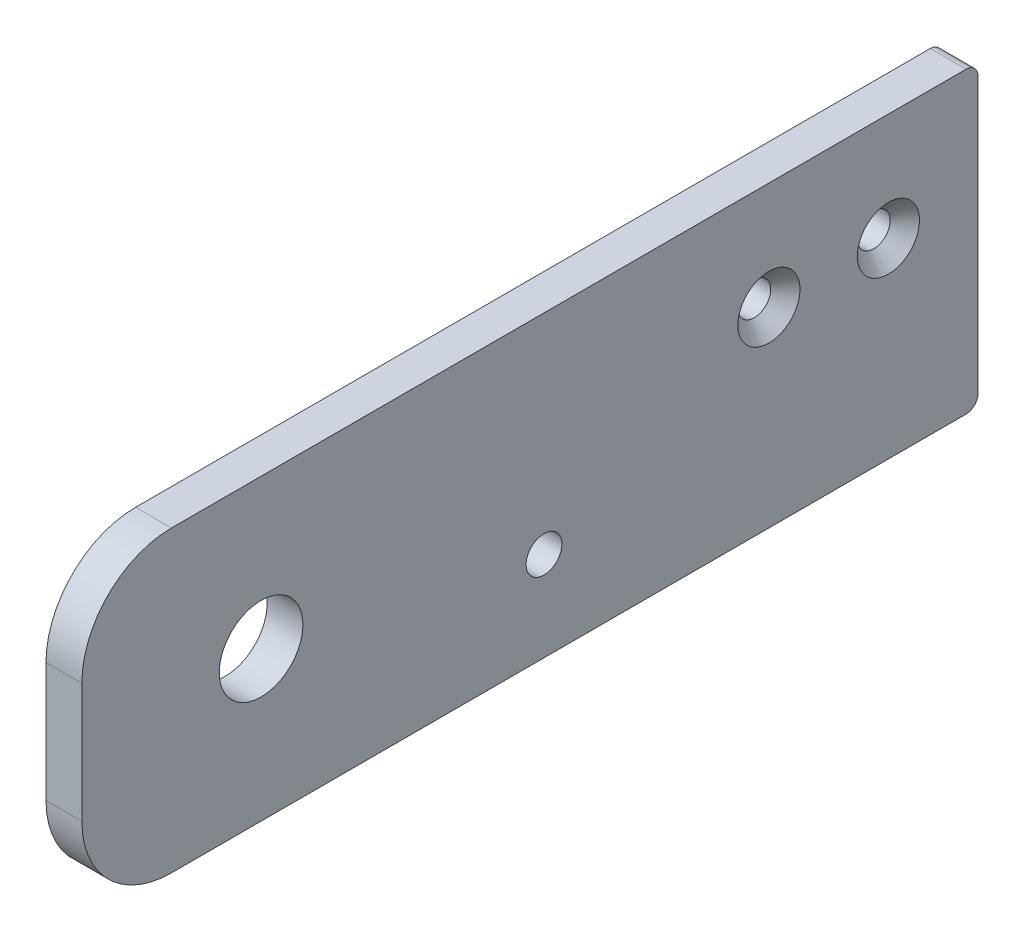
ISO-10303-21;
HEADER;
FILE_DESCRIPTION(('STEP AP214'),'2;1');
FILE_NAME('part.step','',(''),(''),'','','');
FILE_SCHEMA(('AUTOMOTIVE_DESIGN { 1 0 10303 214 1 1 1 1 }'));
ENDSEC;
DATA;
#1=APPLICATION_CONTEXT('core data for automotive mechanical design processes');
#2=APPLICATION_PROTOCOL_DEFINITION('international standard','automotive_design',2000,#1);
#3=PRODUCT_CONTEXT('',#1,'mechanical');
#4=PRODUCT('Part','Part','',(#3));
#5=PRODUCT_RELATED_PRODUCT_CATEGORY('part','',(#4));
#6=PRODUCT_DEFINITION_FORMATION('','',#4);
#7=PRODUCT_DEFINITION_CONTEXT('part definition',#1,'design');
#8=PRODUCT_DEFINITION('design','',#6,#7);
#9=PRODUCT_DEFINITION_SHAPE('','',#8);
#10=(LENGTH_UNIT() NAMED_UNIT(*) SI_UNIT(.MILLI.,.METRE.));
#11=(NAMED_UNIT(*) PLANE_ANGLE_UNIT() SI_UNIT($,.RADIAN.));
#12=(NAMED_UNIT(*) SI_UNIT($,.STERADIAN.) SOLID_ANGLE_UNIT());
#13=UNCERTAINTY_MEASURE_WITH_UNIT(LENGTH_MEASURE(1.E-05),#10,'distance_accuracy_value','');
#14=(GEOMETRIC_REPRESENTATION_CONTEXT(3) GLOBAL_UNCERTAINTY_ASSIGNED_CONTEXT((#13)) GLOBAL_UNIT_ASSIGNED_CONTEXT((#10,
#11,#12)) REPRESENTATION_CONTEXT('',''));
#15=CARTESIAN_POINT('',(0.,0.,0.));
#16=DIRECTION('',(0.,0.,1.));
#17=DIRECTION('',(1.,0.,0.));
#18=AXIS2_PLACEMENT_3D('',#15,#16,#17);
#19=CARTESIAN_POINT('',(0.,-50.,0.));
#20=DIRECTION('',(0.,0.,-1.));
#21=DIRECTION('',(0.,1.,0.));
#22=AXIS2_PLACEMENT_3D('',#19,#20,#21);
#23=PLANE('',#22);
#24=DIRECTION('',(0.,1.,0.));
#25=VECTOR('',#24,1.);
#26=CARTESIAN_POINT('',(0.,-50.,0.));
#27=LINE('',#26,#25);
#28=CARTESIAN_POINT('',(0.,-48.,0.));
#29=VERTEX_POINT('',#28);
#30=CARTESIAN_POINT('',(0.,-2.00000000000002,0.));
#31=VERTEX_POINT('',#30);
#32=EDGE_CURVE('E105',#29,#31,#27,.T.);
#33=ORIENTED_EDGE('',*,*,#32,.T.);
#34=DIRECTION('',(1.,0.,0.));
#35=VECTOR('',#34,1.);
#36=CARTESIAN_POINT('',(0.,-2.00000000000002,0.));
#37=LINE('',#36,#35);
#38=CARTESIAN_POINT('',(6.00000000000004,-2.00000000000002,0.));
#39=VERTEX_POINT('',#38);
#40=EDGE_CURVE('E147',#31,#39,#37,.T.);
#41=ORIENTED_EDGE('',*,*,#40,.T.);
#42=DIRECTION('',(0.,1.,0.));
#43=VECTOR('',#42,1.);
#44=CARTESIAN_POINT('',(6.00000000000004,-50.,0.));
#45=LINE('',#44,#43);
#46=CARTESIAN_POINT('',(6.00000000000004,-48.,0.));
#47=VERTEX_POINT('',#46);
#48=EDGE_CURVE('E153',#47,#39,#45,.T.);
#49=ORIENTED_EDGE('',*,*,#48,.F.);
#50=DIRECTION('',(1.,0.,0.));
#51=VECTOR('',#50,1.);
#52=CARTESIAN_POINT('',(0.,-48.,0.));
#53=LINE('',#52,#51);
#54=EDGE_CURVE('E114',#47,#29,#53,.F.);
#55=ORIENTED_EDGE('',*,*,#54,.T.);
#56=EDGE_LOOP('',(#33,#41,#49,#55));
#57=FACE_BOUND('',#56,.T.);
#58=ADVANCED_FACE('F34',(#57),#23,.T.);
#59=CARTESIAN_POINT('',(0.,-50.,150.));
#60=DIRECTION('',(0.,-1.,0.));
#61=DIRECTION('',(0.,0.,-1.));
#62=AXIS2_PLACEMENT_3D('',#59,#60,#61);
#63=PLANE('',#62);
#64=DIRECTION('',(0.,0.,-1.));
#65=VECTOR('',#64,1.);
#66=CARTESIAN_POINT('',(6.00000000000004,-50.,150.));
#67=LINE('',#66,#65);
#68=CARTESIAN_POINT('',(6.00000000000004,-50.,135.));
#69=VERTEX_POINT('',#68);
#70=CARTESIAN_POINT('',(6.00000000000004,-50.,2.));
#71=VERTEX_POINT('',#70);
#72=EDGE_CURVE('E95',#69,#71,#67,.T.);
#73=ORIENTED_EDGE('',*,*,#72,.F.);
#74=DIRECTION('',(1.,0.,0.));
#75=VECTOR('',#74,1.);
#76=CARTESIAN_POINT('',(0.,-50.,135.));
#77=LINE('',#76,#75);
#78=CARTESIAN_POINT('',(0.,-50.,135.));
#79=VERTEX_POINT('',#78);
#80=EDGE_CURVE('E132',#69,#79,#77,.F.);
#81=ORIENTED_EDGE('',*,*,#80,.T.);
#82=DIRECTION('',(0.,0.,-1.));
#83=VECTOR('',#82,1.);
#84=CARTESIAN_POINT('',(0.,-50.,150.));
#85=LINE('',#84,#83);
#86=CARTESIAN_POINT('',(0.,-50.,2.));
#87=VERTEX_POINT('',#86);
#88=EDGE_CURVE('E118',#79,#87,#85,.T.);
#89=ORIENTED_EDGE('',*,*,#88,.T.);
#90=DIRECTION('',(1.,0.,0.));
#91=VECTOR('',#90,1.);
#92=CARTESIAN_POINT('',(0.,-50.,2.));
#93=LINE('',#92,#91);
#94=EDGE_CURVE('E113',#87,#71,#93,.T.);
#95=ORIENTED_EDGE('',*,*,#94,.T.);
#96=EDGE_LOOP('',(#73,#81,#89,#95));
#97=FACE_BOUND('',#96,.T.);
#98=ADVANCED_FACE('F116',(#97),#63,.T.);
#99=CARTESIAN_POINT('',(0.,0.,150.));
#100=DIRECTION('',(0.,0.,1.));
#101=DIRECTION('',(1.,0.,0.));
#102=AXIS2_PLACEMENT_3D('',#99,#100,#101);
#103=PLANE('',#102);
#104=DIRECTION('',(0.,-1.,0.));
#105=VECTOR('',#104,1.);
#106=CARTESIAN_POINT('',(6.00000000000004,0.,150.));
#107=LINE('',#106,#105);
#108=CARTESIAN_POINT('',(6.00000000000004,-15.,150.));
#109=VERTEX_POINT('',#108);
#110=CARTESIAN_POINT('',(6.00000000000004,-35.,150.));
#111=VERTEX_POINT('',#110);
#112=EDGE_CURVE('E106',#109,#111,#107,.T.);
#113=ORIENTED_EDGE('',*,*,#112,.F.);
#114=DIRECTION('',(1.,0.,0.));
#115=VECTOR('',#114,1.);
#116=CARTESIAN_POINT('',(0.,-15.,150.));
#117=LINE('',#116,#115);
#118=CARTESIAN_POINT('',(0.,-15.,150.));
#119=VERTEX_POINT('',#118);
#120=EDGE_CURVE('E142',#109,#119,#117,.F.);
#121=ORIENTED_EDGE('',*,*,#120,.T.);
#122=DIRECTION('',(0.,-1.,0.));
#123=VECTOR('',#122,1.);
#124=CARTESIAN_POINT('',(0.,0.,150.));
#125=LINE('',#124,#123);
#126=CARTESIAN_POINT('',(0.,-35.,150.));
#127=VERTEX_POINT('',#126);
#128=EDGE_CURVE('E121',#119,#127,#125,.T.);
#129=ORIENTED_EDGE('',*,*,#128,.T.);
#130=DIRECTION('',(1.,0.,0.));
#131=VECTOR('',#130,1.);
#132=CARTESIAN_POINT('',(0.,-35.,150.));
#133=LINE('',#132,#131);
#134=EDGE_CURVE('E128',#127,#111,#133,.T.);
#135=ORIENTED_EDGE('',*,*,#134,.T.);
#136=EDGE_LOOP('',(#113,#121,#129,#135));
#137=FACE_BOUND('',#136,.T.);
#138=ADVANCED_FACE('F173',(#137),#103,.T.);
#139=CARTESIAN_POINT('',(0.,0.,0.));
#140=DIRECTION('',(0.,1.,0.));
#141=DIRECTION('',(0.,0.,1.));
#142=AXIS2_PLACEMENT_3D('',#139,#140,#141);
#143=PLANE('',#142);
#144=DIRECTION('',(0.,0.,1.));
#145=VECTOR('',#144,1.);
#146=CARTESIAN_POINT('',(6.00000000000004,0.,0.));
#147=LINE('',#146,#145);
#148=CARTESIAN_POINT('',(6.00000000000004,0.,1.99999999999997));
#149=VERTEX_POINT('',#148);
#150=CARTESIAN_POINT('',(6.00000000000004,0.,135.));
#151=VERTEX_POINT('',#150);
#152=EDGE_CURVE('E157',#149,#151,#147,.T.);
#153=ORIENTED_EDGE('',*,*,#152,.F.);
#154=DIRECTION('',(1.,0.,0.));
#155=VECTOR('',#154,1.);
#156=CARTESIAN_POINT('',(0.,0.,1.99999999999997));
#157=LINE('',#156,#155);
#158=CARTESIAN_POINT('',(0.,0.,1.99999999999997));
#159=VERTEX_POINT('',#158);
#160=EDGE_CURVE('E42',#149,#159,#157,.F.);
#161=ORIENTED_EDGE('',*,*,#160,.T.);
#162=DIRECTION('',(0.,0.,1.));
#163=VECTOR('',#162,1.);
#164=CARTESIAN_POINT('',(0.,0.,0.));
#165=LINE('',#164,#163);
#166=CARTESIAN_POINT('',(0.,0.,135.));
#167=VERTEX_POINT('',#166);
#168=EDGE_CURVE('E177',#159,#167,#165,.T.);
#169=ORIENTED_EDGE('',*,*,#168,.T.);
#170=DIRECTION('',(1.,0.,0.));
#171=VECTOR('',#170,1.);
#172=CARTESIAN_POINT('',(0.,0.,135.));
#173=LINE('',#172,#171);
#174=EDGE_CURVE('E137',#167,#151,#173,.T.);
#175=ORIENTED_EDGE('',*,*,#174,.T.);
#176=EDGE_LOOP('',(#153,#161,#169,#175));
#177=FACE_BOUND('',#176,.T.);
#178=ADVANCED_FACE('F229',(#177),#143,.T.);
#179=CARTESIAN_POINT('',(0.,0.,0.));
#180=DIRECTION('',(1.,0.,0.));
#181=DIRECTION('',(0.,0.,-1.));
#182=AXIS2_PLACEMENT_3D('',#179,#180,#181);
#183=PLANE('',#182);
#184=CARTESIAN_POINT('',(0.,-25.,120.));
#185=DIRECTION('',(1.,0.,0.));
#186=DIRECTION('',(0.,0.,-1.));
#187=AXIS2_PLACEMENT_3D('',#184,#185,#186);
#188=CIRCLE('',#187,7.);
#189=CARTESIAN_POINT('',(0.,-25.,113.));
#190=VERTEX_POINT('',#189);
#191=EDGE_CURVE('E202',#190,#190,#188,.T.);
#192=ORIENTED_EDGE('',*,*,#191,.T.);
#193=EDGE_LOOP('',(#192));
#194=FACE_BOUND('',#193,.T.);
#195=CARTESIAN_POINT('',(0.,-18.,15.));
#196=DIRECTION('',(1.,0.,0.));
#197=DIRECTION('',(0.,0.,-1.));
#198=AXIS2_PLACEMENT_3D('',#195,#196,#197);
#199=CIRCLE('',#198,2.74999999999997);
#200=CARTESIAN_POINT('',(0.,-18.,12.25));
#201=VERTEX_POINT('',#200);
#202=EDGE_CURVE('E193',#201,#201,#199,.T.);
#203=ORIENTED_EDGE('',*,*,#202,.T.);
#204=EDGE_LOOP('',(#203));
#205=FACE_BOUND('',#204,.T.);
#206=CARTESIAN_POINT('',(0.,-18.,35.));
#207=DIRECTION('',(1.,0.,0.));
#208=DIRECTION('',(0.,0.,-1.));
#209=AXIS2_PLACEMENT_3D('',#206,#207,#208);
#210=CIRCLE('',#209,2.74999999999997);
#211=CARTESIAN_POINT('',(0.,-18.,32.25));
#212=VERTEX_POINT('',#211);
#213=EDGE_CURVE('E183',#212,#212,#210,.T.);
#214=ORIENTED_EDGE('',*,*,#213,.T.);
#215=EDGE_LOOP('',(#214));
#216=FACE_BOUND('',#215,.T.);
#217=CARTESIAN_POINT('',(0.,-35.,72.6436815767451));
#218=DIRECTION('',(-1.,0.,0.));
#219=DIRECTION('',(0.,-1.,0.));
#220=AXIS2_PLACEMENT_3D('',#217,#218,#219);
#221=CIRCLE('',#220,3.00000000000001);
#222=CARTESIAN_POINT('',(0.,-38.,72.6436815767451));
#223=VERTEX_POINT('',#222);
#224=EDGE_CURVE('E162',#223,#223,#221,.T.);
#225=ORIENTED_EDGE('',*,*,#224,.F.);
#226=EDGE_LOOP('',(#225));
#227=FACE_BOUND('',#226,.T.);
#228=ORIENTED_EDGE('',*,*,#168,.F.);
#229=CARTESIAN_POINT('',(0.,-2.00000000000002,1.99999999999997));
#230=DIRECTION('',(1.,0.,0.));
#231=DIRECTION('',(0.,0.,-1.));
#232=AXIS2_PLACEMENT_3D('',#229,#230,#231);
#233=CIRCLE('',#232,2.);
#234=EDGE_CURVE('E11',#159,#31,#233,.F.);
#235=ORIENTED_EDGE('',*,*,#234,.T.);
#236=ORIENTED_EDGE('',*,*,#32,.F.);
#237=CARTESIAN_POINT('',(0.,-48.,2.));
#238=DIRECTION('',(1.,0.,0.));
#239=DIRECTION('',(0.,0.,-1.));
#240=AXIS2_PLACEMENT_3D('',#237,#238,#239);
#241=CIRCLE('',#240,2.);
#242=EDGE_CURVE('E126',#29,#87,#241,.F.);
#243=ORIENTED_EDGE('',*,*,#242,.T.);
#244=ORIENTED_EDGE('',*,*,#88,.F.);
#245=CARTESIAN_POINT('',(0.,-35.,135.));
#246=DIRECTION('',(1.,0.,0.));
#247=DIRECTION('',(0.,0.,-1.));
#248=AXIS2_PLACEMENT_3D('',#245,#246,#247);
#249=CIRCLE('',#248,15.);
#250=EDGE_CURVE('E134',#79,#127,#249,.F.);
#251=ORIENTED_EDGE('',*,*,#250,.T.);
#252=ORIENTED_EDGE('',*,*,#128,.F.);
#253=CARTESIAN_POINT('',(0.,-15.,135.));
#254=DIRECTION('',(1.,0.,0.));
#255=DIRECTION('',(0.,0.,-1.));
#256=AXIS2_PLACEMENT_3D('',#253,#254,#255);
#257=CIRCLE('',#256,15.);
#258=EDGE_CURVE('E144',#119,#167,#257,.F.);
#259=ORIENTED_EDGE('',*,*,#258,.T.);
#260=EDGE_LOOP('',(#228,#235,#236,#243,#244,#251,#252,#259));
#261=FACE_BOUND('',#260,.T.);
#262=ADVANCED_FACE('F178',(#194,#205,#216,#227,#261),#183,.F.);
#263=CARTESIAN_POINT('',(6.00000000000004,0.,0.));
#264=DIRECTION('',(1.,0.,0.));
#265=DIRECTION('',(0.,0.,-1.));
#266=AXIS2_PLACEMENT_3D('',#263,#264,#265);
#267=PLANE('',#266);
#268=CARTESIAN_POINT('',(6.00000000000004,-25.,120.));
#269=DIRECTION('',(1.,0.,0.));
#270=DIRECTION('',(0.,0.,-1.));
#271=AXIS2_PLACEMENT_3D('',#268,#269,#270);
#272=CIRCLE('',#271,7.);
#273=CARTESIAN_POINT('',(6.00000000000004,-25.,113.));
#274=VERTEX_POINT('',#273);
#275=EDGE_CURVE('E205',#274,#274,#272,.T.);
#276=ORIENTED_EDGE('',*,*,#275,.F.);
#277=EDGE_LOOP('',(#276));
#278=FACE_BOUND('',#277,.T.);
#279=CARTESIAN_POINT('',(6.00000000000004,-18.,15.));
#280=DIRECTION('',(1.,0.,0.));
#281=DIRECTION('',(0.,0.,-1.));
#282=AXIS2_PLACEMENT_3D('',#279,#280,#281);
#283=CIRCLE('',#282,5.20000000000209);
#284=CARTESIAN_POINT('',(6.00000000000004,-18.,9.79999999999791));
#285=VERTEX_POINT('',#284);
#286=EDGE_CURVE('E199',#285,#285,#283,.T.);
#287=ORIENTED_EDGE('',*,*,#286,.F.);
#288=EDGE_LOOP('',(#287));
#289=FACE_BOUND('',#288,.T.);
#290=CARTESIAN_POINT('',(6.00000000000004,-18.,35.));
#291=DIRECTION('',(1.,0.,0.));
#292=DIRECTION('',(0.,0.,-1.));
#293=AXIS2_PLACEMENT_3D('',#290,#291,#292);
#294=CIRCLE('',#293,5.20000000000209);
#295=CARTESIAN_POINT('',(6.00000000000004,-18.,29.7999999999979));
#296=VERTEX_POINT('',#295);
#297=EDGE_CURVE('E190',#296,#296,#294,.T.);
#298=ORIENTED_EDGE('',*,*,#297,.F.);
#299=EDGE_LOOP('',(#298));
#300=FACE_BOUND('',#299,.T.);
#301=CARTESIAN_POINT('',(6.00000000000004,-35.,72.6436815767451));
#302=DIRECTION('',(-1.,0.,0.));
#303=DIRECTION('',(0.,-1.,0.));
#304=AXIS2_PLACEMENT_3D('',#301,#302,#303);
#305=CIRCLE('',#304,3.00000000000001);
#306=CARTESIAN_POINT('',(6.00000000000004,-38.,72.6436815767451));
#307=VERTEX_POINT('',#306);
#308=EDGE_CURVE('E158',#307,#307,#305,.T.);
#309=ORIENTED_EDGE('',*,*,#308,.T.);
#310=EDGE_LOOP('',(#309));
#311=FACE_BOUND('',#310,.T.);
#312=ORIENTED_EDGE('',*,*,#48,.T.);
#313=CARTESIAN_POINT('',(6.00000000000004,-2.00000000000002,1.99999999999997));
#314=DIRECTION('',(1.,0.,0.));
#315=DIRECTION('',(0.,0.,-1.));
#316=AXIS2_PLACEMENT_3D('',#313,#314,#315);
#317=CIRCLE('',#316,2.);
#318=EDGE_CURVE('E56',#39,#149,#317,.T.);
#319=ORIENTED_EDGE('',*,*,#318,.T.);
#320=ORIENTED_EDGE('',*,*,#152,.T.);
#321=CARTESIAN_POINT('',(6.00000000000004,-15.,135.));
#322=DIRECTION('',(1.,0.,0.));
#323=DIRECTION('',(0.,0.,-1.));
#324=AXIS2_PLACEMENT_3D('',#321,#322,#323);
#325=CIRCLE('',#324,15.);
#326=EDGE_CURVE('E140',#151,#109,#325,.T.);
#327=ORIENTED_EDGE('',*,*,#326,.T.);
#328=ORIENTED_EDGE('',*,*,#112,.T.);
#329=CARTESIAN_POINT('',(6.00000000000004,-35.,135.));
#330=DIRECTION('',(1.,0.,0.));
#331=DIRECTION('',(0.,0.,-1.));
#332=AXIS2_PLACEMENT_3D('',#329,#330,#331);
#333=CIRCLE('',#332,15.);
#334=EDGE_CURVE('E101',#111,#69,#333,.T.);
#335=ORIENTED_EDGE('',*,*,#334,.T.);
#336=ORIENTED_EDGE('',*,*,#72,.T.);
#337=CARTESIAN_POINT('',(6.00000000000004,-48.,2.));
#338=DIRECTION('',(1.,0.,0.));
#339=DIRECTION('',(0.,0.,-1.));
#340=AXIS2_PLACEMENT_3D('',#337,#338,#339);
#341=CIRCLE('',#340,2.);
#342=EDGE_CURVE('E98',#71,#47,#341,.T.);
#343=ORIENTED_EDGE('',*,*,#342,.T.);
#344=EDGE_LOOP('',(#312,#319,#320,#327,#328,#335,#336,#343));
#345=FACE_BOUND('',#344,.T.);
#346=ADVANCED_FACE('F97',(#278,#289,#300,#311,#345),#267,.T.);
#347=CARTESIAN_POINT('',(6.00000000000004,-35.,72.6436815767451));
#348=DIRECTION('',(-1.,0.,0.));
#349=DIRECTION('',(0.,-1.,0.));
#350=AXIS2_PLACEMENT_3D('',#347,#348,#349);
#351=CYLINDRICAL_SURFACE('',#350,3.00000000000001);
#352=ORIENTED_EDGE('',*,*,#308,.F.);
#353=EDGE_LOOP('',(#352));
#354=FACE_BOUND('',#353,.T.);
#355=ORIENTED_EDGE('',*,*,#224,.T.);
#356=EDGE_LOOP('',(#355));
#357=FACE_BOUND('',#356,.T.);
#358=ADVANCED_FACE('F214',(#354,#357),#351,.F.);
#359=CARTESIAN_POINT('',(6.00000000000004,-18.,35.));
#360=DIRECTION('',(1.,0.,0.));
#361=DIRECTION('',(0.,0.,-1.));
#362=AXIS2_PLACEMENT_3D('',#359,#360,#361);
#363=CYLINDRICAL_SURFACE('',#362,2.74999999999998);
#364=ORIENTED_EDGE('',*,*,#213,.F.);
#365=EDGE_LOOP('',(#364));
#366=FACE_BOUND('',#365,.T.);
#367=CARTESIAN_POINT('',(3.54999999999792,-18.,35.));
#368=DIRECTION('',(1.,0.,0.));
#369=DIRECTION('',(0.,0.,-1.));
#370=AXIS2_PLACEMENT_3D('',#367,#368,#369);
#371=CIRCLE('',#370,2.74999999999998);
#372=CARTESIAN_POINT('',(3.54999999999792,-18.,32.25));
#373=VERTEX_POINT('',#372);
#374=EDGE_CURVE('E187',#373,#373,#371,.T.);
#375=ORIENTED_EDGE('',*,*,#374,.T.);
#376=EDGE_LOOP('',(#375));
#377=FACE_BOUND('',#376,.T.);
#378=ADVANCED_FACE('F224',(#366,#377),#363,.F.);
#379=CARTESIAN_POINT('',(6.00000000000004,-18.,35.));
#380=DIRECTION('',(1.,0.,0.));
#381=DIRECTION('',(0.,0.,-1.));
#382=AXIS2_PLACEMENT_3D('',#379,#380,#381);
#383=CONICAL_SURFACE('',#382,5.20000000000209,0.785398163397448);
#384=ORIENTED_EDGE('',*,*,#374,.F.);
#385=EDGE_LOOP('',(#384));
#386=FACE_BOUND('',#385,.T.);
#387=ORIENTED_EDGE('',*,*,#297,.T.);
#388=EDGE_LOOP('',(#387));
#389=FACE_BOUND('',#388,.T.);
#390=ADVANCED_FACE('F269',(#386,#389),#383,.F.);
#391=CARTESIAN_POINT('',(6.00000000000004,-18.,15.));
#392=DIRECTION('',(1.,0.,0.));
#393=DIRECTION('',(0.,0.,-1.));
#394=AXIS2_PLACEMENT_3D('',#391,#392,#393);
#395=CYLINDRICAL_SURFACE('',#394,2.74999999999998);
#396=ORIENTED_EDGE('',*,*,#202,.F.);
#397=EDGE_LOOP('',(#396));
#398=FACE_BOUND('',#397,.T.);
#399=CARTESIAN_POINT('',(3.54999999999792,-18.,15.));
#400=DIRECTION('',(1.,0.,0.));
#401=DIRECTION('',(0.,0.,-1.));
#402=AXIS2_PLACEMENT_3D('',#399,#400,#401);
#403=CIRCLE('',#402,2.74999999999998);
#404=CARTESIAN_POINT('',(3.54999999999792,-18.,12.25));
#405=VERTEX_POINT('',#404);
#406=EDGE_CURVE('E196',#405,#405,#403,.T.);
#407=ORIENTED_EDGE('',*,*,#406,.T.);
#408=EDGE_LOOP('',(#407));
#409=FACE_BOUND('',#408,.T.);
#410=ADVANCED_FACE('F265',(#398,#409),#395,.F.);
#411=CARTESIAN_POINT('',(6.00000000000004,-18.,15.));
#412=DIRECTION('',(1.,0.,0.));
#413=DIRECTION('',(0.,0.,-1.));
#414=AXIS2_PLACEMENT_3D('',#411,#412,#413);
#415=CONICAL_SURFACE('',#414,5.20000000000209,0.785398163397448);
#416=ORIENTED_EDGE('',*,*,#406,.F.);
#417=EDGE_LOOP('',(#416));
#418=FACE_BOUND('',#417,.T.);
#419=ORIENTED_EDGE('',*,*,#286,.T.);
#420=EDGE_LOOP('',(#419));
#421=FACE_BOUND('',#420,.T.);
#422=ADVANCED_FACE('F247',(#418,#421),#415,.F.);
#423=CARTESIAN_POINT('',(0.,-48.,2.));
#424=DIRECTION('',(1.,0.,0.));
#425=DIRECTION('',(0.,0.,-1.));
#426=AXIS2_PLACEMENT_3D('',#423,#424,#425);
#427=CYLINDRICAL_SURFACE('',#426,2.);
#428=ORIENTED_EDGE('',*,*,#242,.F.);
#429=ORIENTED_EDGE('',*,*,#54,.F.);
#430=ORIENTED_EDGE('',*,*,#342,.F.);
#431=ORIENTED_EDGE('',*,*,#94,.F.);
#432=EDGE_LOOP('',(#428,#429,#430,#431));
#433=FACE_BOUND('',#432,.T.);
#434=ADVANCED_FACE('F112',(#433),#427,.T.);
#435=CARTESIAN_POINT('',(0.,-35.,135.));
#436=DIRECTION('',(1.,0.,0.));
#437=DIRECTION('',(0.,0.,-1.));
#438=AXIS2_PLACEMENT_3D('',#435,#436,#437);
#439=CYLINDRICAL_SURFACE('',#438,15.);
#440=ORIENTED_EDGE('',*,*,#250,.F.);
#441=ORIENTED_EDGE('',*,*,#80,.F.);
#442=ORIENTED_EDGE('',*,*,#334,.F.);
#443=ORIENTED_EDGE('',*,*,#134,.F.);
#444=EDGE_LOOP('',(#440,#441,#442,#443));
#445=FACE_BOUND('',#444,.T.);
#446=ADVANCED_FACE('F172',(#445),#439,.T.);
#447=CARTESIAN_POINT('',(0.,-15.,135.));
#448=DIRECTION('',(1.,0.,0.));
#449=DIRECTION('',(0.,0.,-1.));
#450=AXIS2_PLACEMENT_3D('',#447,#448,#449);
#451=CYLINDRICAL_SURFACE('',#450,15.);
#452=ORIENTED_EDGE('',*,*,#258,.F.);
#453=ORIENTED_EDGE('',*,*,#120,.F.);
#454=ORIENTED_EDGE('',*,*,#326,.F.);
#455=ORIENTED_EDGE('',*,*,#174,.F.);
#456=EDGE_LOOP('',(#452,#453,#454,#455));
#457=FACE_BOUND('',#456,.T.);
#458=ADVANCED_FACE('F249',(#457),#451,.T.);
#459=CARTESIAN_POINT('',(0.,-2.00000000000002,1.99999999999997));
#460=DIRECTION('',(1.,0.,0.));
#461=DIRECTION('',(0.,0.,-1.));
#462=AXIS2_PLACEMENT_3D('',#459,#460,#461);
#463=CYLINDRICAL_SURFACE('',#462,2.);
#464=ORIENTED_EDGE('',*,*,#234,.F.);
#465=ORIENTED_EDGE('',*,*,#160,.F.);
#466=ORIENTED_EDGE('',*,*,#318,.F.);
#467=ORIENTED_EDGE('',*,*,#40,.F.);
#468=EDGE_LOOP('',(#464,#465,#466,#467));
#469=FACE_BOUND('',#468,.T.);
#470=ADVANCED_FACE('F36',(#469),#463,.T.);
#471=CARTESIAN_POINT('',(-3.99999999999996,-25.,120.));
#472=DIRECTION('',(1.,0.,0.));
#473=DIRECTION('',(0.,0.,-1.));
#474=AXIS2_PLACEMENT_3D('',#471,#472,#473);
#475=CYLINDRICAL_SURFACE('',#474,7.);
#476=ORIENTED_EDGE('',*,*,#275,.T.);
#477=EDGE_LOOP('',(#476));
#478=FACE_BOUND('',#477,.T.);
#479=ORIENTED_EDGE('',*,*,#191,.F.);
#480=EDGE_LOOP('',(#479));
#481=FACE_BOUND('',#480,.T.);
#482=ADVANCED_FACE('F209',(#478,#481),#475,.F.);
#483=CLOSED_SHELL('',(#58,#98,#138,#178,#262,#346,#358,#378,#390,#410,#422,#434,#446,#458,#470,#482));
#484=MANIFOLD_SOLID_BREP('B2',#483);
#485=ADVANCED_BREP_SHAPE_REPRESENTATION('',(#18,#484),#14);
#486=SHAPE_DEFINITION_REPRESENTATION(#9,#485);
ENDSEC;
END-ISO-10303-21;
